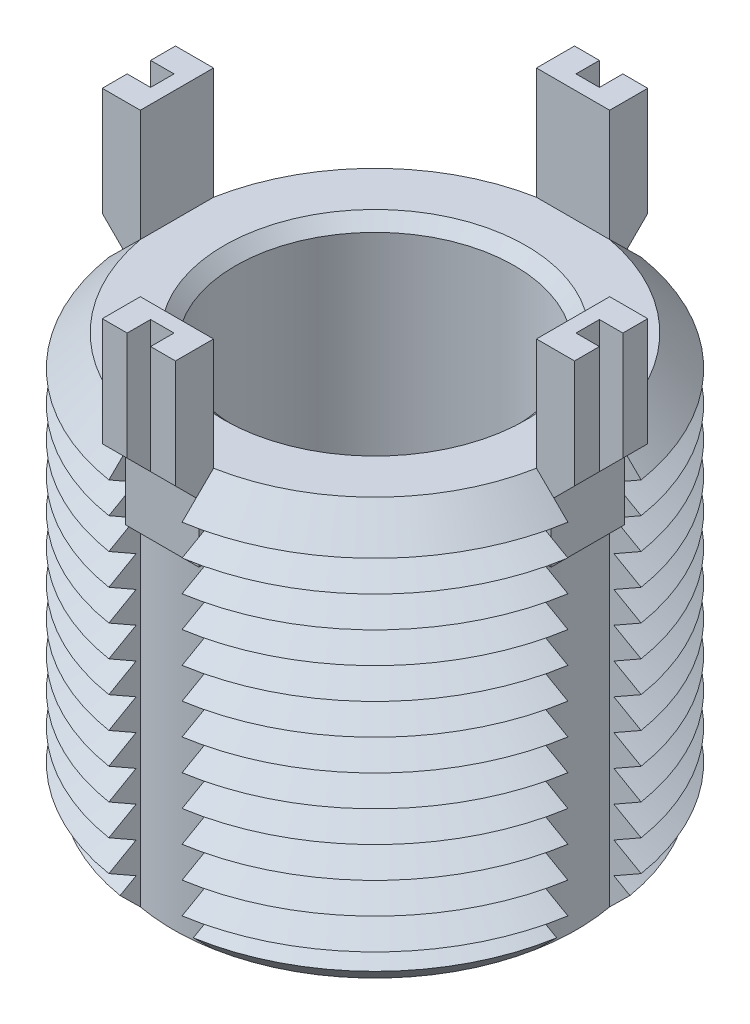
from build123d import *

# Parameters (mm, degrees)
SKETCH1_R               = 15.875
BOSS_EXTRUDE1_DEPTH     = 28.448
CHAMFER1_SIZE           = 2.117
LPATTERN1_COUNT         = 12
LPATTERN1_PITCH         = 2.117
CUT_EXTRUDE1_REACH      = 38.24
CIRPATTERN1_COUNT       = 4
BOSS_EXTRUDE3_DEPTH     = 2.5
CIRPATTERN2_COUNT       = 4
CUT_EXTRUDE3_DEPTH      = 43.699878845
CUT_EXTRUDE3_DEPTH_BACK = 43.699878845
SKETCH6_W               = 1.6
SKETCH6_H               = 1.6
SKETCH7_R               = 9.525
CUT_EXTRUDE4_DEPTH      = 28.448
CHAMFER2_SIZE           = 0.7935


with BuildPart() as part:
    # Sketch1 → Boss-Extrude1 (new body)
    with BuildSketch(Plane(origin=(0, 0, 0), x_dir=(1, 0, 0), z_dir=(0, 1, 0))):
        with Locations(Location((0, 0, 0), (0, 0, 270))):
            Circle(SKETCH1_R)
    extrude(amount=-BOSS_EXTRUDE1_DEPTH)

    # Chamfer1
    chamfer1_edges = [part.edges().sort_by_distance(p)[0] for p in [
        (0, 0, -15.875),
        (0, -28.448, -15.875),
    ]]
    chamfer(chamfer1_edges, length=CHAMFER1_SIZE)

    # Sketch3 → Cut-Revolve1 (revolve, cut)
    with BuildSketch(Plane(origin=(0, 0, 0), x_dir=(0, 0, -1), z_dir=(1, 0, 0))):
        Polygon((-15.875, -2.117), (-14.04162422, -3.1755), (-15.875, -4.234), align=None)
    cut_revolve1 = revolve(axis=Axis((0, 0.885892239, 0), (0, -1, 0)), mode=Mode.SUBTRACT)

    # LPattern1: Cut-Revolve1 ×12
    with Locations(*[(0, -i * LPATTERN1_PITCH, 0) for i in range(1, LPATTERN1_COUNT)]):
        add(cut_revolve1, mode=Mode.SUBTRACT)

    # Cut-Extrude1: up to this cone (the profile starts inside it)
    cut_extrude1_end = Plane(origin=(0, 0, 0), z_dir=(0, 1, 0)).offset(-42.205999) * Cone(1e-06, 123.152, 123.151999, align=(Align.CENTER, Align.CENTER, Align.MIN), mode=Mode.PRIVATE)
    # Sketch4 → Cut-Extrude1 (cut, up to the surface)
    with BuildSketch(Plane(origin=(0, 0, 0), x_dir=(1, 0, 0), z_dir=(0, 1, 0)), mode=Mode.PRIVATE) as cut_extrude1_sk1:
        with BuildLine():
            Line((-13.528952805, 2.5), (-15.676913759, 2.5))
            ThreePointArc((-15.676913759, 2.5), (-15.875, 0), (-15.676913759, -2.5))
            Line((-15.676913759, -2.5), (-13.528952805, -2.5))
            ThreePointArc((-13.528952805, -2.5), (-13.758, 0), (-13.528952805, 2.5))
        make_face()
    cut_extrude1_tool1 = extrude(cut_extrude1_sk1.sketch, amount=-CUT_EXTRUDE1_REACH, mode=Mode.PRIVATE) & cut_extrude1_end
    cut_extrude1 = cut_extrude1_tool1.solids().sort_by_distance((-14.745247, 0, 0))[0]
    add(cut_extrude1, mode=Mode.SUBTRACT)

    # CirPattern1: Cut-Extrude1 ×4 about axis
    cirpattern1_axis = Axis((0, 0, 0), (0, 1, 0))
    for i in range(1, CIRPATTERN1_COUNT):
        add(cut_extrude1.rotate(cirpattern1_axis, i * 360 / CIRPATTERN1_COUNT), mode=Mode.SUBTRACT)

    # Sketch5 → Boss-Extrude3 (add, symmetric)
    with BuildSketch(Plane(origin=(0, 0, 0), x_dir=(0, 0, -1), z_dir=(1, 0, 0))):
        Polygon((-13.528952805, 7.649), (-13.528952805, -5.351), (-14.528952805, -5.351), (-14.528952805, -1.351), (-16.128952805, 0.249), (-16.128952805, 7.649), align=None)
    boss_extrude3 = extrude(amount=BOSS_EXTRUDE3_DEPTH, both=True)

    # CirPattern2: Boss-Extrude3 ×4 about axis
    cirpattern2_axis = Axis((0, 0, 0), (0, 1, 0))
    for i in range(1, CIRPATTERN2_COUNT):
        add(boss_extrude3.rotate(cirpattern2_axis, i * 360 / CIRPATTERN2_COUNT))

    # Sketch6 → Cut-Extrude3 (cut, two sides: drawn at the far end of the back side and taken through both)
    with BuildSketch(Plane(origin=(0, 7.649, 0), x_dir=(1, 0, 0), z_dir=(0, 1, 0)).offset(-CUT_EXTRUDE3_DEPTH_BACK)):
        with Locations((-15.328952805, 0)):
            Rectangle(SKETCH6_W, SKETCH6_H)
        with Locations((0, 15.328952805)):
            Rectangle(SKETCH6_W, SKETCH6_H)
        with Locations((15.328952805, 0)):
            Rectangle(SKETCH6_W, SKETCH6_H)
        with Locations((0, -15.328952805)):
            Rectangle(SKETCH6_W, SKETCH6_H)
    extrude(amount=CUT_EXTRUDE3_DEPTH + CUT_EXTRUDE3_DEPTH_BACK, mode=Mode.SUBTRACT)

    # Sketch7 → Cut-Extrude4 (cut)
    with BuildSketch(Plane(origin=(0, 0, 0), x_dir=(1, 0, 0), z_dir=(0, 1, 0))):
        with Locations(Location((0, 0, 0), (0, 0, 270))):
            Circle(SKETCH7_R)
    extrude(amount=-CUT_EXTRUDE4_DEPTH, mode=Mode.SUBTRACT)

    # Chamfer2
    chamfer2_edges = [part.edges().sort_by_distance(p)[0] for p in [
        (0, 0, -9.525),
        (0, -28.448, -9.525),
    ]]
    chamfer(chamfer2_edges, length=CHAMFER2_SIZE)


solid = part.part
